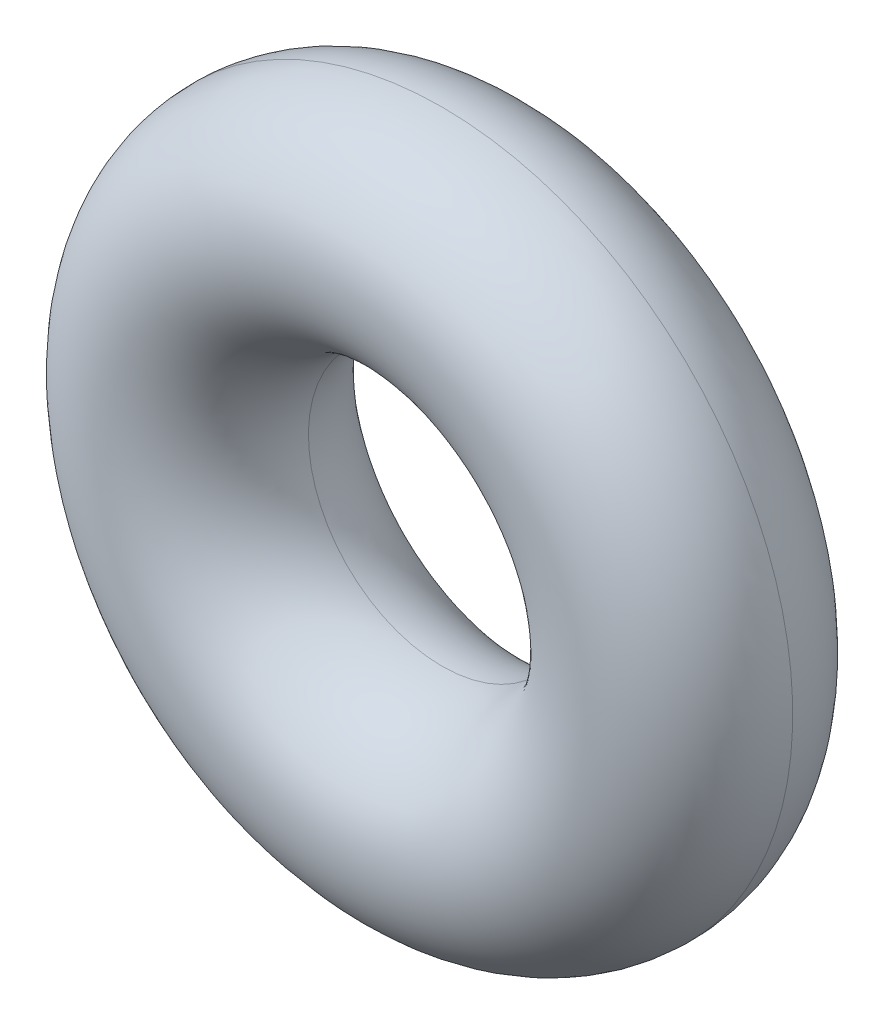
ISO-10303-21;
HEADER;
FILE_DESCRIPTION(('STEP AP214'),'2;1');
FILE_NAME('part.step','',(''),(''),'','','');
FILE_SCHEMA(('AUTOMOTIVE_DESIGN { 1 0 10303 214 1 1 1 1 }'));
ENDSEC;
DATA;
#1=APPLICATION_CONTEXT('core data for automotive mechanical design processes');
#2=APPLICATION_PROTOCOL_DEFINITION('international standard','automotive_design',2000,#1);
#3=PRODUCT_CONTEXT('',#1,'mechanical');
#4=PRODUCT('Part','Part','',(#3));
#5=PRODUCT_RELATED_PRODUCT_CATEGORY('part','',(#4));
#6=PRODUCT_DEFINITION_FORMATION('','',#4);
#7=PRODUCT_DEFINITION_CONTEXT('part definition',#1,'design');
#8=PRODUCT_DEFINITION('design','',#6,#7);
#9=PRODUCT_DEFINITION_SHAPE('','',#8);
#10=(LENGTH_UNIT() NAMED_UNIT(*) SI_UNIT(.MILLI.,.METRE.));
#11=(NAMED_UNIT(*) PLANE_ANGLE_UNIT() SI_UNIT($,.RADIAN.));
#12=(NAMED_UNIT(*) SI_UNIT($,.STERADIAN.) SOLID_ANGLE_UNIT());
#13=UNCERTAINTY_MEASURE_WITH_UNIT(LENGTH_MEASURE(1.E-05),#10,'distance_accuracy_value','');
#14=(GEOMETRIC_REPRESENTATION_CONTEXT(3) GLOBAL_UNCERTAINTY_ASSIGNED_CONTEXT((#13)) GLOBAL_UNIT_ASSIGNED_CONTEXT((#10,
#11,#12)) REPRESENTATION_CONTEXT('',''));
#15=CARTESIAN_POINT('',(0.,0.,0.));
#16=DIRECTION('',(0.,0.,1.));
#17=DIRECTION('',(1.,0.,0.));
#18=AXIS2_PLACEMENT_3D('',#15,#16,#17);
#19=CARTESIAN_POINT('',(0.,0.,0.8255));
#20=DIRECTION('',(0.,0.,1.));
#21=DIRECTION('',(0.,-1.,0.));
#22=AXIS2_PLACEMENT_3D('',#19,#20,#21);
#23=TOROIDAL_SURFACE('',#22,1.8415,0.8255);
#24=CARTESIAN_POINT('',(0.,0.,0.8255));
#25=DIRECTION('',(0.,0.,1.));
#26=DIRECTION('',(0.,-1.,0.));
#27=AXIS2_PLACEMENT_3D('',#24,#25,#26);
#28=CIRCLE('',#27,1.016);
#29=CARTESIAN_POINT('',(0.,-1.016,0.8255));
#30=VERTEX_POINT('',#29);
#31=EDGE_CURVE('E18',#30,#30,#28,.T.);
#32=ORIENTED_EDGE('',*,*,#31,.F.);
#33=EDGE_LOOP('',(#32));
#34=FACE_BOUND('',#33,.T.);
#35=CARTESIAN_POINT('',(0.,0.,0.8255));
#36=DIRECTION('',(0.,0.,-1.));
#37=DIRECTION('',(0.,1.,0.));
#38=AXIS2_PLACEMENT_3D('',#35,#36,#37);
#39=CIRCLE('',#38,2.667);
#40=CARTESIAN_POINT('',(0.,2.667,0.8255));
#41=VERTEX_POINT('',#40);
#42=EDGE_CURVE('E8',#41,#41,#39,.T.);
#43=ORIENTED_EDGE('',*,*,#42,.F.);
#44=EDGE_LOOP('',(#43));
#45=FACE_BOUND('',#44,.T.);
#46=ADVANCED_FACE('F12',(#34,#45),#23,.T.);
#47=ORIENTED_EDGE('',*,*,#42,.T.);
#48=EDGE_LOOP('',(#47));
#49=FACE_BOUND('',#48,.T.);
#50=ORIENTED_EDGE('',*,*,#31,.T.);
#51=EDGE_LOOP('',(#50));
#52=FACE_BOUND('',#51,.T.);
#53=ADVANCED_FACE('F14',(#49,#52),#23,.T.);
#54=CLOSED_SHELL('',(#46,#53));
#55=MANIFOLD_SOLID_BREP('B1',#54);
#56=ADVANCED_BREP_SHAPE_REPRESENTATION('',(#18,#55),#14);
#57=SHAPE_DEFINITION_REPRESENTATION(#9,#56);
ENDSEC;
END-ISO-10303-21;
